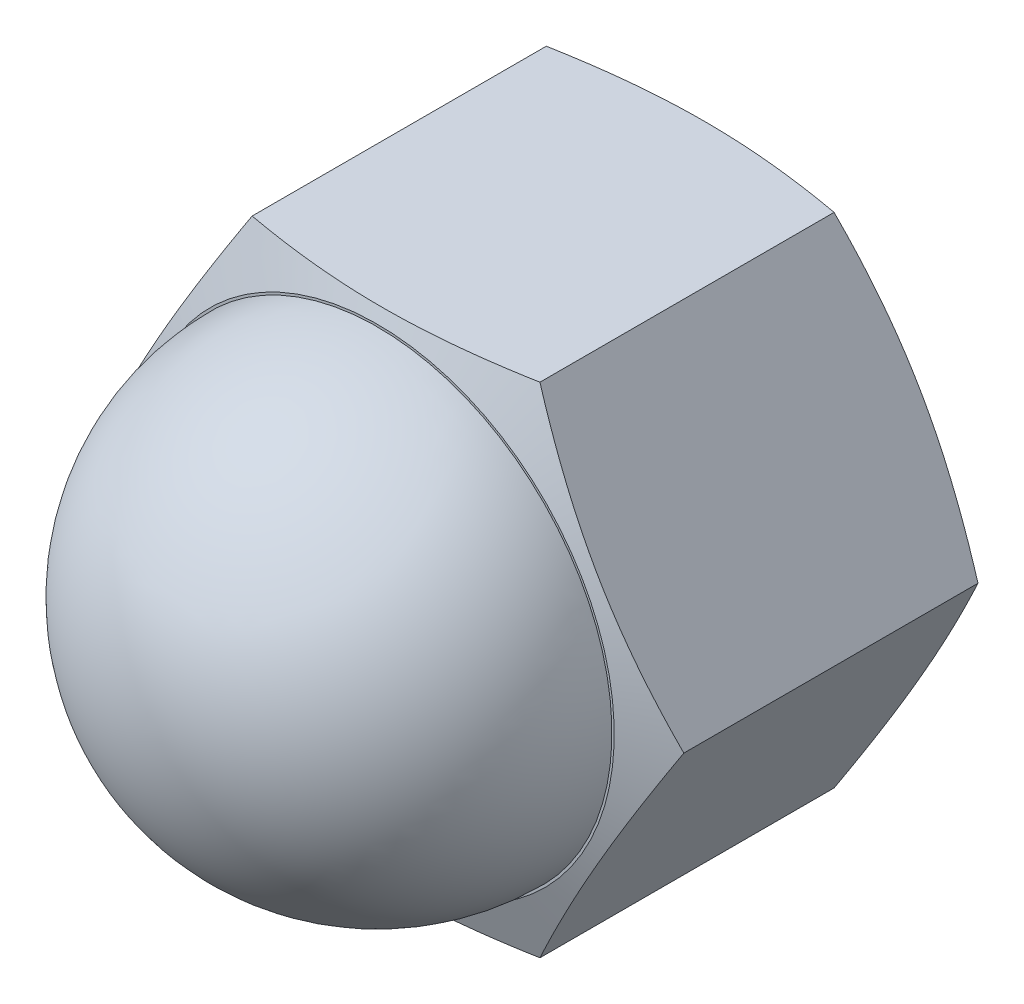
ISO-10303-21;
HEADER;
FILE_DESCRIPTION(('STEP AP214'),'2;1');
FILE_NAME('part.step','',(''),(''),'','','');
FILE_SCHEMA(('AUTOMOTIVE_DESIGN { 1 0 10303 214 1 1 1 1 }'));
ENDSEC;
DATA;
#1=APPLICATION_CONTEXT('core data for automotive mechanical design processes');
#2=APPLICATION_PROTOCOL_DEFINITION('international standard','automotive_design',2000,#1);
#3=PRODUCT_CONTEXT('',#1,'mechanical');
#4=PRODUCT('Part','Part','',(#3));
#5=PRODUCT_RELATED_PRODUCT_CATEGORY('part','',(#4));
#6=PRODUCT_DEFINITION_FORMATION('','',#4);
#7=PRODUCT_DEFINITION_CONTEXT('part definition',#1,'design');
#8=PRODUCT_DEFINITION('design','',#6,#7);
#9=PRODUCT_DEFINITION_SHAPE('','',#8);
#10=(LENGTH_UNIT() NAMED_UNIT(*) SI_UNIT(.MILLI.,.METRE.));
#11=(NAMED_UNIT(*) PLANE_ANGLE_UNIT() SI_UNIT($,.RADIAN.));
#12=(NAMED_UNIT(*) SI_UNIT($,.STERADIAN.) SOLID_ANGLE_UNIT());
#13=UNCERTAINTY_MEASURE_WITH_UNIT(LENGTH_MEASURE(1.E-05),#10,'distance_accuracy_value','');
#14=(GEOMETRIC_REPRESENTATION_CONTEXT(3) GLOBAL_UNCERTAINTY_ASSIGNED_CONTEXT((#13)) GLOBAL_UNIT_ASSIGNED_CONTEXT((#10,
#11,#12)) REPRESENTATION_CONTEXT('',''));
#15=CARTESIAN_POINT('',(0.,0.,0.));
#16=DIRECTION('',(0.,0.,1.));
#17=DIRECTION('',(1.,0.,0.));
#18=AXIS2_PLACEMENT_3D('',#15,#16,#17);
#19=CARTESIAN_POINT('',(0.,-9.77999999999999,0.));
#20=DIRECTION('',(0.,0.,-1.));
#21=DIRECTION('',(-1.,0.,0.));
#22=AXIS2_PLACEMENT_3D('',#19,#20,#21);
#23=PLANE('',#22);
#24=CARTESIAN_POINT('',(0.,0.,0.));
#25=DIRECTION('',(0.,0.,-1.));
#26=DIRECTION('',(-1.,0.,0.));
#27=AXIS2_PLACEMENT_3D('',#24,#25,#26);
#28=CIRCLE('',#27,4.6455);
#29=CARTESIAN_POINT('',(-4.6455,0.,0.));
#30=VERTEX_POINT('',#29);
#31=EDGE_CURVE('E362',#30,#30,#28,.T.);
#32=ORIENTED_EDGE('',*,*,#31,.F.);
#33=EDGE_LOOP('',(#32));
#34=FACE_BOUND('',#33,.T.);
#35=CARTESIAN_POINT('',(0.,0.,0.));
#36=DIRECTION('',(0.,0.,-1.));
#37=DIRECTION('',(-1.,0.,0.));
#38=AXIS2_PLACEMENT_3D('',#35,#36,#37);
#39=CIRCLE('',#38,4.6);
#40=CARTESIAN_POINT('',(-4.6,0.,0.));
#41=VERTEX_POINT('',#40);
#42=EDGE_CURVE('E129',#41,#41,#39,.F.);
#43=ORIENTED_EDGE('',*,*,#42,.F.);
#44=EDGE_LOOP('',(#43));
#45=FACE_BOUND('',#44,.T.);
#46=ADVANCED_FACE('F35',(#34,#45),#23,.F.);
#47=CARTESIAN_POINT('',(0.,0.,-6.5));
#48=DIRECTION('',(0.,0.,1.));
#49=DIRECTION('',(1.,0.,0.));
#50=AXIS2_PLACEMENT_3D('',#47,#48,#49);
#51=CYLINDRICAL_SURFACE('',#50,2.5);
#52=CARTESIAN_POINT('',(0.,0.,-5.85000000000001));
#53=DIRECTION('',(0.,0.,-1.));
#54=DIRECTION('',(-1.,0.,0.));
#55=AXIS2_PLACEMENT_3D('',#52,#53,#54);
#56=CIRCLE('',#55,2.5);
#57=CARTESIAN_POINT('',(2.5,0.,-5.85000000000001));
#58=VERTEX_POINT('',#57);
#59=EDGE_CURVE('E11',#58,#58,#56,.T.);
#60=CARTESIAN_POINT('',(0.,0.,-1.5));
#61=DIRECTION('',(0.,0.,1.));
#62=DIRECTION('',(1.,0.,0.));
#63=AXIS2_PLACEMENT_3D('',#60,#61,#62);
#64=CIRCLE('',#63,2.5);
#65=CARTESIAN_POINT('',(2.5,0.,-1.5));
#66=VERTEX_POINT('',#65);
#67=EDGE_CURVE('E126',#66,#66,#64,.F.);
#68=CARTESIAN_POINT('',(2.5,0.,-5.85000000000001));
#69=CARTESIAN_POINT('',(2.5,0.,-5.80468750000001));
#70=CARTESIAN_POINT('',(2.5,0.,-5.75937500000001));
#71=CARTESIAN_POINT('',(2.5,0.,-5.66875000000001));
#72=CARTESIAN_POINT('',(2.5,0.,-5.62343750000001));
#73=CARTESIAN_POINT('',(2.5,0.,-5.53281250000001));
#74=CARTESIAN_POINT('',(2.5,0.,-5.48750000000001));
#75=CARTESIAN_POINT('',(2.5,0.,-5.39687500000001));
#76=CARTESIAN_POINT('',(2.5,0.,-5.35156250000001));
#77=CARTESIAN_POINT('',(2.5,0.,-5.26093750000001));
#78=CARTESIAN_POINT('',(2.5,0.,-5.21562500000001));
#79=CARTESIAN_POINT('',(2.5,0.,-5.12500000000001));
#80=CARTESIAN_POINT('',(2.5,0.,-5.07968750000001));
#81=CARTESIAN_POINT('',(2.5,0.,-4.98906250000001));
#82=CARTESIAN_POINT('',(2.5,0.,-4.94375000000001));
#83=CARTESIAN_POINT('',(2.5,0.,-4.85312500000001));
#84=CARTESIAN_POINT('',(2.5,0.,-4.80781250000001));
#85=CARTESIAN_POINT('',(2.5,0.,-4.71718750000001));
#86=CARTESIAN_POINT('',(2.5,0.,-4.67187500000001));
#87=CARTESIAN_POINT('',(2.5,0.,-4.58125000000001));
#88=CARTESIAN_POINT('',(2.5,0.,-4.53593750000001));
#89=CARTESIAN_POINT('',(2.5,0.,-4.44531250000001));
#90=CARTESIAN_POINT('',(2.5,0.,-4.40000000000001));
#91=CARTESIAN_POINT('',(2.5,0.,-4.30937500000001));
#92=CARTESIAN_POINT('',(2.5,0.,-4.26406250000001));
#93=CARTESIAN_POINT('',(2.5,0.,-4.17343750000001));
#94=CARTESIAN_POINT('',(2.5,0.,-4.12812500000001));
#95=CARTESIAN_POINT('',(2.5,0.,-4.03750000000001));
#96=CARTESIAN_POINT('',(2.5,0.,-3.99218750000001));
#97=CARTESIAN_POINT('',(2.5,0.,-3.90156250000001));
#98=CARTESIAN_POINT('',(2.5,0.,-3.85625000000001));
#99=CARTESIAN_POINT('',(2.5,0.,-3.76562500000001));
#100=CARTESIAN_POINT('',(2.5,0.,-3.72031250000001));
#101=CARTESIAN_POINT('',(2.5,0.,-3.62968750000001));
#102=CARTESIAN_POINT('',(2.5,0.,-3.584375));
#103=CARTESIAN_POINT('',(2.5,0.,-3.49375000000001));
#104=CARTESIAN_POINT('',(2.5,0.,-3.4484375));
#105=CARTESIAN_POINT('',(2.5,0.,-3.3578125));
#106=CARTESIAN_POINT('',(2.5,0.,-3.3125));
#107=CARTESIAN_POINT('',(2.5,0.,-3.221875));
#108=CARTESIAN_POINT('',(2.5,0.,-3.1765625));
#109=CARTESIAN_POINT('',(2.5,0.,-3.0859375));
#110=CARTESIAN_POINT('',(2.5,0.,-3.040625));
#111=CARTESIAN_POINT('',(2.5,0.,-2.95));
#112=CARTESIAN_POINT('',(2.5,0.,-2.9046875));
#113=CARTESIAN_POINT('',(2.5,0.,-2.8140625));
#114=CARTESIAN_POINT('',(2.5,0.,-2.76875));
#115=CARTESIAN_POINT('',(2.5,0.,-2.678125));
#116=CARTESIAN_POINT('',(2.5,0.,-2.6328125));
#117=CARTESIAN_POINT('',(2.5,0.,-2.5421875));
#118=CARTESIAN_POINT('',(2.5,0.,-2.496875));
#119=CARTESIAN_POINT('',(2.5,0.,-2.40625));
#120=CARTESIAN_POINT('',(2.5,0.,-2.3609375));
#121=CARTESIAN_POINT('',(2.5,0.,-2.2703125));
#122=CARTESIAN_POINT('',(2.5,0.,-2.225));
#123=CARTESIAN_POINT('',(2.5,0.,-2.134375));
#124=CARTESIAN_POINT('',(2.5,0.,-2.0890625));
#125=CARTESIAN_POINT('',(2.5,0.,-1.9984375));
#126=CARTESIAN_POINT('',(2.5,0.,-1.953125));
#127=CARTESIAN_POINT('',(2.5,0.,-1.8625));
#128=CARTESIAN_POINT('',(2.5,0.,-1.8171875));
#129=CARTESIAN_POINT('',(2.5,0.,-1.7265625));
#130=CARTESIAN_POINT('',(2.5,0.,-1.68125));
#131=CARTESIAN_POINT('',(2.5,0.,-1.590625));
#132=CARTESIAN_POINT('',(2.5,0.,-1.5453125));
#133=CARTESIAN_POINT('',(2.5,0.,-1.5));
#134=B_SPLINE_CURVE_WITH_KNOTS('',3,(#68,#69,#70,#71,#72,#73,#74,#75,#76,#77,#78,#79,#80,#81,
#82,#83,#84,#85,#86,#87,#88,#89,#90,#91,#92,#93,#94,#95,#96,#97,#98,#99,#100,#101,#102,#103,
#104,#105,#106,#107,#108,#109,#110,#111,#112,#113,#114,#115,#116,#117,#118,#119,#120,#121,#122,
#123,#124,#125,#126,#127,#128,#129,#130,#131,#132,#133),.UNSPECIFIED.,.F.,.F.,(4,2,2,2,2,2,2,2,
2,2,2,2,2,2,2,2,2,2,2,2,2,2,2,2,2,2,2,2,2,2,2,2,4),(0.,0.1359375,0.271875,0.407812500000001,
0.543750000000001,0.679687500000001,0.815625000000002,0.951562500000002,1.0875,1.2234375,
1.359375,1.4953125,1.63125,1.7671875,1.903125,2.0390625,2.17500000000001,2.31093750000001,
2.44687500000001,2.58281250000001,2.71875000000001,2.85468750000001,2.99062500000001,
3.12656250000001,3.26250000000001,3.39843750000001,3.53437500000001,3.67031250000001,
3.80625000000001,3.94218750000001,4.07812500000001,4.21406250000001,4.35000000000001),.UNSPECIFIED.);
#135=EDGE_CURVE('BSEAM148',#58,#66,#134,.T.);
#136=ORIENTED_EDGE('',*,*,#59,.T.);
#137=ORIENTED_EDGE('',*,*,#67,.F.);
#138=ORIENTED_EDGE('',*,*,#135,.T.);
#139=ORIENTED_EDGE('',*,*,#135,.F.);
#140=EDGE_LOOP('',(#136,#138,#137,#139));
#141=FACE_BOUND('',#140,.T.);
#142=ADVANCED_FACE('F148',(#141),#51,.F.);
#143=CARTESIAN_POINT('',(2.82324281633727,-4.89,-6.5));
#144=DIRECTION('',(0.866025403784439,-0.5,0.));
#145=DIRECTION('',(0.5,0.866025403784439,0.));
#146=AXIS2_PLACEMENT_3D('',#143,#144,#145);
#147=PLANE('',#146);
#148=CARTESIAN_POINT('',(2.82312734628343,-4.8902,-0.364371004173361));
#149=CARTESIAN_POINT('',(2.94005354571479,-4.68767788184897,-0.321796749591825));
#150=CARTESIAN_POINT('',(3.05736532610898,-4.48448791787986,-0.28306804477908));
#151=CARTESIAN_POINT('',(3.29275168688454,-4.07678678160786,-0.214930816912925));
#152=CARTESIAN_POINT('',(3.4108267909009,-3.87227470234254,-0.18552958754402));
#153=CARTESIAN_POINT('',(3.64642938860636,-3.46419903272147,-0.137973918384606));
#154=CARTESIAN_POINT('',(3.76395150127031,-3.26064476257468,-0.119715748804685));
#155=CARTESIAN_POINT('',(3.9992705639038,-2.85306019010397,-0.0952264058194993));
#156=CARTESIAN_POINT('',(4.11706739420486,-2.64903009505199,-0.0889907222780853));
#157=CARTESIAN_POINT('',(4.35266105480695,-2.24096990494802,-0.0889907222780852));
#158=CARTESIAN_POINT('',(4.470457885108,-2.03693980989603,-0.0952264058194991));
#159=CARTESIAN_POINT('',(4.7057769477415,-1.62935523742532,-0.119715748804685));
#160=CARTESIAN_POINT('',(4.82329906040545,-1.42580096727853,-0.137973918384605));
#161=CARTESIAN_POINT('',(5.05890165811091,-1.01772529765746,-0.185529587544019));
#162=CARTESIAN_POINT('',(5.17697676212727,-0.813213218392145,-0.214930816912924));
#163=CARTESIAN_POINT('',(5.41236312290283,-0.405512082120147,-0.283068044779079));
#164=CARTESIAN_POINT('',(5.52967490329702,-0.202322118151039,-0.321796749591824));
#165=CARTESIAN_POINT('',(5.64660110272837,0.000199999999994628,-0.36437100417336));
#166=B_SPLINE_CURVE_WITH_KNOTS('',3,(#148,#149,#150,#151,#152,#153,#154,#155,#156,#157,#158,
#159,#160,#161,#162,#163,#164,#165),.UNSPECIFIED.,.F.,.F.,(4,2,2,2,2,2,2,2,4),(0.,
0.713162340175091,1.42688097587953,2.13385008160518,2.84055392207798,3.54725776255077,
4.25422686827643,4.96794550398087,5.68110784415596),.UNSPECIFIED.);
#167=CARTESIAN_POINT('',(2.82324281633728,-4.89,-0.364328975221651));
#168=VERTEX_POINT('',#167);
#169=CARTESIAN_POINT('',(5.64648563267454,0.,-0.364328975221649));
#170=VERTEX_POINT('',#169);
#171=EDGE_CURVE('E50',#168,#170,#166,.T.);
#172=ORIENTED_EDGE('',*,*,#171,.F.);
#173=DIRECTION('',(0.,0.,1.));
#174=VECTOR('',#173,1.);
#175=CARTESIAN_POINT('',(2.82324281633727,-4.89,-6.5));
#176=LINE('',#175,#174);
#177=CARTESIAN_POINT('',(2.82324281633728,-4.89,-6.13567102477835));
#178=VERTEX_POINT('',#177);
#179=EDGE_CURVE('E114',#178,#168,#176,.T.);
#180=ORIENTED_EDGE('',*,*,#179,.F.);
#181=CARTESIAN_POINT('',(5.64660110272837,0.000199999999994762,-6.13562899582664));
#182=CARTESIAN_POINT('',(5.52967490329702,-0.202322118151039,-6.17820325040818));
#183=CARTESIAN_POINT('',(5.41236312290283,-0.405512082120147,-6.21693195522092));
#184=CARTESIAN_POINT('',(5.17697676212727,-0.813213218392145,-6.28506918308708));
#185=CARTESIAN_POINT('',(5.05890165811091,-1.01772529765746,-6.31447041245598));
#186=CARTESIAN_POINT('',(4.82329906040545,-1.42580096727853,-6.36202608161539));
#187=CARTESIAN_POINT('',(4.7057769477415,-1.62935523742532,-6.38028425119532));
#188=CARTESIAN_POINT('',(4.470457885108,-2.03693980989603,-6.4047735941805));
#189=CARTESIAN_POINT('',(4.35266105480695,-2.24096990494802,-6.41100927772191));
#190=CARTESIAN_POINT('',(4.11706739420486,-2.64903009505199,-6.41100927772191));
#191=CARTESIAN_POINT('',(3.99927056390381,-2.85306019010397,-6.4047735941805));
#192=CARTESIAN_POINT('',(3.76395150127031,-3.26064476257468,-6.38028425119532));
#193=CARTESIAN_POINT('',(3.64642938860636,-3.46419903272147,-6.36202608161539));
#194=CARTESIAN_POINT('',(3.4108267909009,-3.87227470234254,-6.31447041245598));
#195=CARTESIAN_POINT('',(3.29275168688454,-4.07678678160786,-6.28506918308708));
#196=CARTESIAN_POINT('',(3.05736532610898,-4.48448791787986,-6.21693195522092));
#197=CARTESIAN_POINT('',(2.94005354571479,-4.68767788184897,-6.17820325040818));
#198=CARTESIAN_POINT('',(2.82312734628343,-4.8902,-6.13562899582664));
#199=B_SPLINE_CURVE_WITH_KNOTS('',3,(#181,#182,#183,#184,#185,#186,#187,#188,#189,#190,#191,
#192,#193,#194,#195,#196,#197,#198),.UNSPECIFIED.,.F.,.F.,(4,2,2,2,2,2,2,2,4),(0.,
0.71316234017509,1.42688097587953,2.13385008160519,2.84055392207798,3.54725776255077,
4.25422686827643,4.96794550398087,5.68110784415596),.UNSPECIFIED.);
#200=CARTESIAN_POINT('',(5.64648563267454,0.,-6.13567102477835));
#201=VERTEX_POINT('',#200);
#202=EDGE_CURVE('E125',#201,#178,#199,.T.);
#203=ORIENTED_EDGE('',*,*,#202,.F.);
#204=DIRECTION('',(0.,0.,1.));
#205=VECTOR('',#204,1.);
#206=CARTESIAN_POINT('',(5.64648563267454,0.,-6.5));
#207=LINE('',#206,#205);
#208=EDGE_CURVE('E122',#201,#170,#207,.T.);
#209=ORIENTED_EDGE('',*,*,#208,.T.);
#210=EDGE_LOOP('',(#172,#180,#203,#209));
#211=FACE_BOUND('',#210,.T.);
#212=ADVANCED_FACE('F154',(#211),#147,.T.);
#213=CARTESIAN_POINT('',(-2.82324281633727,-4.89,-6.5));
#214=DIRECTION('',(0.,-1.,0.));
#215=DIRECTION('',(1.,0.,0.));
#216=AXIS2_PLACEMENT_3D('',#213,#214,#215);
#217=PLANE('',#216);
#218=CARTESIAN_POINT('',(-7.46648006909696,-4.89,-1.55770848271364));
#219=CARTESIAN_POINT('',(-7.24532550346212,-4.89,-1.49038994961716));
#220=CARTESIAN_POINT('',(-7.02392678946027,-4.89,-1.42385881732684));
#221=CARTESIAN_POINT('',(-6.58051678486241,-4.89,-1.29280697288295));
#222=CARTESIAN_POINT('',(-6.35850544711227,-4.89,-1.22828642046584));
#223=CARTESIAN_POINT('',(-5.91336404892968,-4.89,-1.10158350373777));
#224=CARTESIAN_POINT('',(-5.69023267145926,-4.89,-1.03940574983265));
#225=CARTESIAN_POINT('',(-5.24313869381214,-4.89,-0.91811857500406));
#226=CARTESIAN_POINT('',(-5.01917610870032,-4.89,-0.859009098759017));
#227=CARTESIAN_POINT('',(-4.57304751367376,-4.89,-0.745325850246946));
#228=CARTESIAN_POINT('',(-4.35089355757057,-4.89,-0.690705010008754));
#229=CARTESIAN_POINT('',(-3.90549201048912,-4.89,-0.586129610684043));
#230=CARTESIAN_POINT('',(-3.68224446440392,-4.89,-0.536174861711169));
#231=CARTESIAN_POINT('',(-3.23458821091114,-4.89,-0.442094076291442));
#232=CARTESIAN_POINT('',(-3.01017989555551,-4.89,-0.397966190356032));
#233=CARTESIAN_POINT('',(-2.56006087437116,-4.89,-0.316886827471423));
#234=CARTESIAN_POINT('',(-2.33435021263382,-4.89,-0.279935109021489));
#235=CARTESIAN_POINT('',(-1.90705783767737,-4.89,-0.218370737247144));
#236=CARTESIAN_POINT('',(-1.70560980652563,-4.89,-0.192838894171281));
#237=CARTESIAN_POINT('',(-1.301864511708,-4.89,-0.14964780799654));
#238=CARTESIAN_POINT('',(-1.09956727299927,-4.89,-0.131988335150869));
#239=CARTESIAN_POINT('',(-0.694534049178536,-4.89,-0.105392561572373));
#240=CARTESIAN_POINT('',(-0.491798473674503,-4.89,-0.0964501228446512));
#241=CARTESIAN_POINT('',(-0.0861282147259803,-4.89,-0.0877409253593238));
#242=CARTESIAN_POINT('',(0.116806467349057,-4.89,-0.0879741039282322));
#243=CARTESIAN_POINT('',(0.523489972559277,-4.89,-0.0976280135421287));
#244=CARTESIAN_POINT('',(0.727237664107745,-4.89,-0.107095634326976));
#245=CARTESIAN_POINT('',(1.13413234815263,-4.89,-0.134783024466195));
#246=CARTESIAN_POINT('',(1.33727932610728,-4.89,-0.153003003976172));
#247=CARTESIAN_POINT('',(1.74287320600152,-4.89,-0.197344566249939));
#248=CARTESIAN_POINT('',(1.94531935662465,-4.89,-0.223472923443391));
#249=CARTESIAN_POINT('',(2.34919879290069,-4.89,-0.282573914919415));
#250=CARTESIAN_POINT('',(2.55063207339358,-4.89,-0.315546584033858));
#251=CARTESIAN_POINT('',(2.96373484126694,-4.89,-0.389278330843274));
#252=CARTESIAN_POINT('',(3.17534434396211,-4.89,-0.430370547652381));
#253=CARTESIAN_POINT('',(3.59747447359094,-4.89,-0.517843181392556));
#254=CARTESIAN_POINT('',(3.80799501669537,-4.89,-0.564223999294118));
#255=CARTESIAN_POINT('',(4.2280989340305,-4.89,-0.66129601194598));
#256=CARTESIAN_POINT('',(4.43768201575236,-4.89,-0.711988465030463));
#257=CARTESIAN_POINT('',(4.85596286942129,-4.89,-0.81686395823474));
#258=CARTESIAN_POINT('',(5.06466066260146,-4.89,-0.871046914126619));
#259=CARTESIAN_POINT('',(5.69015659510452,-4.89,-1.03795915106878));
#260=CARTESIAN_POINT('',(6.1058225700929,-4.89,-1.15492449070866));
#261=CARTESIAN_POINT('',(6.93487258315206,-4.89,-1.39634529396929));
#262=CARTESIAN_POINT('',(7.34825697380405,-4.89,-1.52079956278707));
#263=CARTESIAN_POINT('',(8.16879776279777,-4.89,-1.7734793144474));
#264=CARTESIAN_POINT('',(8.57597204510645,-4.89,-1.90164691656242));
#265=CARTESIAN_POINT('',(9.38917810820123,-4.89,-2.16160997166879));
#266=CARTESIAN_POINT('',(9.79520983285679,-4.89,-2.29340559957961));
#267=CARTESIAN_POINT('',(10.6048627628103,-4.89,-2.55913592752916));
#268=CARTESIAN_POINT('',(11.0084872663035,-4.89,-2.69306060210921));
#269=CARTESIAN_POINT('',(11.815030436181,-4.89,-2.96291077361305));
#270=CARTESIAN_POINT('',(12.2179491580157,-4.89,-3.09883610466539));
#271=CARTESIAN_POINT('',(12.6206270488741,-4.89,-3.23546098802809));
#272=B_SPLINE_CURVE_WITH_KNOTS('',3,(#218,#219,#220,#221,#222,#223,#224,#225,#226,#227,#228,
#229,#230,#231,#232,#233,#234,#235,#236,#237,#238,#239,#240,#241,#242,#243,#244,#245,#246,#247,
#248,#249,#250,#251,#252,#253,#254,#255,#256,#257,#258,#259,#260,#261,#262,#263,#264,#265,#266,
#267,#268,#269,#270,#271),.UNSPECIFIED.,.F.,.F.,(4,2,2,2,2,2,2,2,2,2,2,2,2,2,2,2,2,2,2,2,2,2,2,
2,2,2,4),(0.,0.693525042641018,1.38710504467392,2.08198536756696,2.77685315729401,
3.46312406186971,4.14936702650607,4.83539164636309,5.52139317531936,6.13043788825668,
6.73946482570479,7.34806261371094,7.95665624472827,8.56835630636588,9.18007105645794,
9.79231130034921,10.404554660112,11.0511588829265,11.6978121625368,12.3446548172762,
12.9914818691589,14.2867843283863,15.5818806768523,16.862465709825,18.1431125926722,
19.4188955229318,20.6945732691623),.UNSPECIFIED.);
#273=CARTESIAN_POINT('',(-2.82324281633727,-4.89000000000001,-0.364328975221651));
#274=VERTEX_POINT('',#273);
#275=EDGE_CURVE('E107',#274,#168,#272,.T.);
#276=ORIENTED_EDGE('',*,*,#275,.F.);
#277=DIRECTION('',(0.,0.,1.));
#278=VECTOR('',#277,1.);
#279=CARTESIAN_POINT('',(-2.82324281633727,-4.89,-6.5));
#280=LINE('',#279,#278);
#281=CARTESIAN_POINT('',(-2.82324281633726,-4.89000000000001,-6.13567102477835));
#282=VERTEX_POINT('',#281);
#283=EDGE_CURVE('E106',#282,#274,#280,.T.);
#284=ORIENTED_EDGE('',*,*,#283,.F.);
#285=CARTESIAN_POINT('',(-7.46648006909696,-4.89,-4.94229151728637));
#286=CARTESIAN_POINT('',(-7.24532550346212,-4.89,-5.00961005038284));
#287=CARTESIAN_POINT('',(-7.02392678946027,-4.89,-5.07614118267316));
#288=CARTESIAN_POINT('',(-6.58051678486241,-4.89,-5.20719302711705));
#289=CARTESIAN_POINT('',(-6.35850544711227,-4.89,-5.27171357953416));
#290=CARTESIAN_POINT('',(-5.91336404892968,-4.89,-5.39841649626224));
#291=CARTESIAN_POINT('',(-5.69023267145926,-4.89,-5.46059425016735));
#292=CARTESIAN_POINT('',(-5.24313869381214,-4.89,-5.58188142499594));
#293=CARTESIAN_POINT('',(-5.01917610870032,-4.89,-5.64099090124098));
#294=CARTESIAN_POINT('',(-4.57304751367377,-4.89,-5.75467414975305));
#295=CARTESIAN_POINT('',(-4.35089355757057,-4.89,-5.80929498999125));
#296=CARTESIAN_POINT('',(-3.90549201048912,-4.89,-5.91387038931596));
#297=CARTESIAN_POINT('',(-3.68224446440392,-4.89,-5.96382513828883));
#298=CARTESIAN_POINT('',(-3.23458821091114,-4.89,-6.05790592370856));
#299=CARTESIAN_POINT('',(-3.01017989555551,-4.89,-6.10203380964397));
#300=CARTESIAN_POINT('',(-2.56006087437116,-4.89,-6.18311317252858));
#301=CARTESIAN_POINT('',(-2.33435021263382,-4.89,-6.22006489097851));
#302=CARTESIAN_POINT('',(-1.90705783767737,-4.89,-6.28162926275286));
#303=CARTESIAN_POINT('',(-1.70560980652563,-4.89,-6.30716110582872));
#304=CARTESIAN_POINT('',(-1.301864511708,-4.89,-6.35035219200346));
#305=CARTESIAN_POINT('',(-1.09956727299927,-4.89,-6.36801166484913));
#306=CARTESIAN_POINT('',(-0.694534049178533,-4.89,-6.39460743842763));
#307=CARTESIAN_POINT('',(-0.4917984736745,-4.89,-6.40354987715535));
#308=CARTESIAN_POINT('',(-0.0861282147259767,-4.89,-6.41225907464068));
#309=CARTESIAN_POINT('',(0.116806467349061,-4.89,-6.41202589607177));
#310=CARTESIAN_POINT('',(0.523489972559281,-4.89,-6.40237198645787));
#311=CARTESIAN_POINT('',(0.727237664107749,-4.89,-6.39290436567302));
#312=CARTESIAN_POINT('',(1.13413234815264,-4.89,-6.36521697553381));
#313=CARTESIAN_POINT('',(1.33727932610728,-4.89,-6.34699699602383));
#314=CARTESIAN_POINT('',(1.74287320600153,-4.89,-6.30265543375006));
#315=CARTESIAN_POINT('',(1.94531935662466,-4.89,-6.27652707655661));
#316=CARTESIAN_POINT('',(2.3491987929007,-4.89,-6.21742608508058));
#317=CARTESIAN_POINT('',(2.55063207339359,-4.89,-6.18445341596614));
#318=CARTESIAN_POINT('',(2.96373484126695,-4.89,-6.11072166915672));
#319=CARTESIAN_POINT('',(3.17534434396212,-4.89,-6.06962945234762));
#320=CARTESIAN_POINT('',(3.59747447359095,-4.89,-5.98215681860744));
#321=CARTESIAN_POINT('',(3.80799501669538,-4.89,-5.93577600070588));
#322=CARTESIAN_POINT('',(4.22809893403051,-4.89,-5.83870398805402));
#323=CARTESIAN_POINT('',(4.43768201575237,-4.89,-5.78801153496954));
#324=CARTESIAN_POINT('',(4.85596286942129,-4.89,-5.68313604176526));
#325=CARTESIAN_POINT('',(5.06466066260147,-4.89,-5.62895308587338));
#326=CARTESIAN_POINT('',(5.69015659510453,-4.89,-5.46204084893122));
#327=CARTESIAN_POINT('',(6.10582257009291,-4.89,-5.34507550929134));
#328=CARTESIAN_POINT('',(6.93487258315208,-4.89,-5.10365470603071));
#329=CARTESIAN_POINT('',(7.34825697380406,-4.89,-4.97920043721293));
#330=CARTESIAN_POINT('',(8.16879776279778,-4.89,-4.7265206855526));
#331=CARTESIAN_POINT('',(8.57597204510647,-4.89,-4.59835308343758));
#332=CARTESIAN_POINT('',(9.38917810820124,-4.89,-4.33839002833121));
#333=CARTESIAN_POINT('',(9.79520983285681,-4.89,-4.20659440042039));
#334=CARTESIAN_POINT('',(10.6048627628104,-4.89,-3.94086407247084));
#335=CARTESIAN_POINT('',(11.0084872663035,-4.89,-3.80693939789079));
#336=CARTESIAN_POINT('',(11.8150304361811,-4.89,-3.53708922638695));
#337=CARTESIAN_POINT('',(12.2179491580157,-4.89,-3.40116389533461));
#338=CARTESIAN_POINT('',(12.6206270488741,-4.89,-3.26453901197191));
#339=B_SPLINE_CURVE_WITH_KNOTS('',3,(#285,#286,#287,#288,#289,#290,#291,#292,#293,#294,#295,
#296,#297,#298,#299,#300,#301,#302,#303,#304,#305,#306,#307,#308,#309,#310,#311,#312,#313,#314,
#315,#316,#317,#318,#319,#320,#321,#322,#323,#324,#325,#326,#327,#328,#329,#330,#331,#332,#333,
#334,#335,#336,#337,#338),.UNSPECIFIED.,.F.,.F.,(4,2,2,2,2,2,2,2,2,2,2,2,2,2,2,2,2,2,2,2,2,2,2,
2,2,2,4),(0.,0.693525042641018,1.38710504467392,2.08198536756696,2.77685315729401,
3.46312406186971,4.14936702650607,4.83539164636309,5.52139317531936,6.13043788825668,
6.7394648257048,7.34806261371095,7.95665624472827,8.56835630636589,9.18007105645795,
9.79231130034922,10.404554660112,11.0511588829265,11.6978121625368,12.3446548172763,
12.991481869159,14.2867843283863,15.5818806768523,16.862465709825,18.1431125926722,
19.4188955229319,20.6945732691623),.UNSPECIFIED.);
#340=EDGE_CURVE('E170',#178,#282,#339,.F.);
#341=ORIENTED_EDGE('',*,*,#340,.F.);
#342=ORIENTED_EDGE('',*,*,#179,.T.);
#343=EDGE_LOOP('',(#276,#284,#341,#342));
#344=FACE_BOUND('',#343,.T.);
#345=ADVANCED_FACE('F161',(#344),#217,.T.);
#346=CARTESIAN_POINT('',(-5.64648563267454,0.,-6.5));
#347=DIRECTION('',(-0.866025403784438,-0.5,0.));
#348=DIRECTION('',(0.5,-0.866025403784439,0.));
#349=AXIS2_PLACEMENT_3D('',#346,#347,#348);
#350=PLANE('',#349);
#351=CARTESIAN_POINT('',(-5.64660110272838,0.000200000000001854,-0.364371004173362));
#352=CARTESIAN_POINT('',(-5.52967490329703,-0.202322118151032,-0.321796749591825));
#353=CARTESIAN_POINT('',(-5.41236312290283,-0.40551208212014,-0.283068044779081));
#354=CARTESIAN_POINT('',(-5.17697676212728,-0.813213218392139,-0.214930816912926));
#355=CARTESIAN_POINT('',(-5.05890165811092,-1.01772529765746,-0.18552958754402));
#356=CARTESIAN_POINT('',(-4.82329906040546,-1.42580096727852,-0.137973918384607));
#357=CARTESIAN_POINT('',(-4.70577694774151,-1.62935523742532,-0.119715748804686));
#358=CARTESIAN_POINT('',(-4.47045788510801,-2.03693980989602,-0.0952264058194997));
#359=CARTESIAN_POINT('',(-4.35266105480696,-2.24096990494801,-0.0889907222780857));
#360=CARTESIAN_POINT('',(-4.11706739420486,-2.64903009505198,-0.0889907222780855));
#361=CARTESIAN_POINT('',(-3.99927056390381,-2.85306019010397,-0.0952264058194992));
#362=CARTESIAN_POINT('',(-3.76395150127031,-3.26064476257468,-0.119715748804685));
#363=CARTESIAN_POINT('',(-3.64642938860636,-3.46419903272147,-0.137973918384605));
#364=CARTESIAN_POINT('',(-3.4108267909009,-3.87227470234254,-0.185529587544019));
#365=CARTESIAN_POINT('',(-3.29275168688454,-4.07678678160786,-0.214930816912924));
#366=CARTESIAN_POINT('',(-3.05736532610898,-4.48448791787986,-0.28306804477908));
#367=CARTESIAN_POINT('',(-2.94005354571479,-4.68767788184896,-0.321796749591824));
#368=CARTESIAN_POINT('',(-2.82312734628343,-4.8902,-0.364371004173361));
#369=B_SPLINE_CURVE_WITH_KNOTS('',3,(#351,#352,#353,#354,#355,#356,#357,#358,#359,#360,#361,
#362,#363,#364,#365,#366,#367,#368),.UNSPECIFIED.,.F.,.F.,(4,2,2,2,2,2,2,2,4),(0.,
0.713162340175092,1.42688097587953,2.13385008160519,2.84055392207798,3.54725776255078,
4.25422686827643,4.96794550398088,5.68110784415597),.UNSPECIFIED.);
#370=CARTESIAN_POINT('',(-5.64648563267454,0.,-0.364328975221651));
#371=VERTEX_POINT('',#370);
#372=EDGE_CURVE('E90',#371,#274,#369,.T.);
#373=ORIENTED_EDGE('',*,*,#372,.F.);
#374=DIRECTION('',(0.,0.,1.));
#375=VECTOR('',#374,1.);
#376=CARTESIAN_POINT('',(-5.64648563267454,0.,-6.5));
#377=LINE('',#376,#375);
#378=CARTESIAN_POINT('',(-5.64648563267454,0.,-6.13567102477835));
#379=VERTEX_POINT('',#378);
#380=EDGE_CURVE('E104',#379,#371,#377,.T.);
#381=ORIENTED_EDGE('',*,*,#380,.F.);
#382=CARTESIAN_POINT('',(-2.82312734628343,-4.8902,-6.13562899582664));
#383=CARTESIAN_POINT('',(-2.94005354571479,-4.68767788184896,-6.17820325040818));
#384=CARTESIAN_POINT('',(-3.05736532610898,-4.48448791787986,-6.21693195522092));
#385=CARTESIAN_POINT('',(-3.29275168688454,-4.07678678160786,-6.28506918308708));
#386=CARTESIAN_POINT('',(-3.4108267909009,-3.87227470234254,-6.31447041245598));
#387=CARTESIAN_POINT('',(-3.64642938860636,-3.46419903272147,-6.36202608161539));
#388=CARTESIAN_POINT('',(-3.76395150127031,-3.26064476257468,-6.38028425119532));
#389=CARTESIAN_POINT('',(-3.99927056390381,-2.85306019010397,-6.4047735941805));
#390=CARTESIAN_POINT('',(-4.11706739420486,-2.64903009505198,-6.41100927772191));
#391=CARTESIAN_POINT('',(-4.35266105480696,-2.24096990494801,-6.41100927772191));
#392=CARTESIAN_POINT('',(-4.47045788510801,-2.03693980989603,-6.4047735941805));
#393=CARTESIAN_POINT('',(-4.70577694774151,-1.62935523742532,-6.38028425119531));
#394=CARTESIAN_POINT('',(-4.82329906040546,-1.42580096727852,-6.36202608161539));
#395=CARTESIAN_POINT('',(-5.05890165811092,-1.01772529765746,-6.31447041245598));
#396=CARTESIAN_POINT('',(-5.17697676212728,-0.813213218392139,-6.28506918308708));
#397=CARTESIAN_POINT('',(-5.41236312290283,-0.40551208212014,-6.21693195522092));
#398=CARTESIAN_POINT('',(-5.52967490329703,-0.202322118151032,-6.17820325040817));
#399=CARTESIAN_POINT('',(-5.64660110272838,0.000200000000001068,-6.13562899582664));
#400=B_SPLINE_CURVE_WITH_KNOTS('',3,(#382,#383,#384,#385,#386,#387,#388,#389,#390,#391,#392,
#393,#394,#395,#396,#397,#398,#399),.UNSPECIFIED.,.F.,.F.,(4,2,2,2,2,2,2,2,4),(0.,
0.713162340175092,1.42688097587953,2.13385008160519,2.84055392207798,3.54725776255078,
4.25422686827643,4.96794550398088,5.68110784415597),.UNSPECIFIED.);
#401=EDGE_CURVE('E233',#282,#379,#400,.T.);
#402=ORIENTED_EDGE('',*,*,#401,.F.);
#403=ORIENTED_EDGE('',*,*,#283,.T.);
#404=EDGE_LOOP('',(#373,#381,#402,#403));
#405=FACE_BOUND('',#404,.T.);
#406=ADVANCED_FACE('F102',(#405),#350,.T.);
#407=CARTESIAN_POINT('',(-2.82324281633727,4.89,-6.5));
#408=DIRECTION('',(-0.866025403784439,0.5,0.));
#409=DIRECTION('',(-0.5,-0.866025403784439,0.));
#410=AXIS2_PLACEMENT_3D('',#407,#408,#409);
#411=PLANE('',#410);
#412=CARTESIAN_POINT('',(-2.82312734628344,4.8902,-0.364371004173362));
#413=CARTESIAN_POINT('',(-2.94005354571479,4.68767788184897,-0.321796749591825));
#414=CARTESIAN_POINT('',(-3.05736532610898,4.48448791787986,-0.283068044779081));
#415=CARTESIAN_POINT('',(-3.29275168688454,4.07678678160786,-0.214930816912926));
#416=CARTESIAN_POINT('',(-3.4108267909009,3.87227470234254,-0.185529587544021));
#417=CARTESIAN_POINT('',(-3.64642938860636,3.46419903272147,-0.137973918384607));
#418=CARTESIAN_POINT('',(-3.76395150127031,3.26064476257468,-0.119715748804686));
#419=CARTESIAN_POINT('',(-3.99927056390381,2.85306019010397,-0.0952264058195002));
#420=CARTESIAN_POINT('',(-4.11706739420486,2.64903009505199,-0.0889907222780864));
#421=CARTESIAN_POINT('',(-4.35266105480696,2.24096990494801,-0.0889907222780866));
#422=CARTESIAN_POINT('',(-4.47045788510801,2.03693980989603,-0.0952264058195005));
#423=CARTESIAN_POINT('',(-4.70577694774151,1.62935523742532,-0.119715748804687));
#424=CARTESIAN_POINT('',(-4.82329906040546,1.42580096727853,-0.137973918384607));
#425=CARTESIAN_POINT('',(-5.05890165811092,1.01772529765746,-0.185529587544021));
#426=CARTESIAN_POINT('',(-5.17697676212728,0.813213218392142,-0.214930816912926));
#427=CARTESIAN_POINT('',(-5.41236312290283,0.405512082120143,-0.283068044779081));
#428=CARTESIAN_POINT('',(-5.52967490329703,0.202322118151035,-0.321796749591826));
#429=CARTESIAN_POINT('',(-5.64660110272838,-0.000199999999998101,-0.364371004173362));
#430=B_SPLINE_CURVE_WITH_KNOTS('',3,(#412,#413,#414,#415,#416,#417,#418,#419,#420,#421,#422,
#423,#424,#425,#426,#427,#428,#429),.UNSPECIFIED.,.F.,.F.,(4,2,2,2,2,2,2,2,4),(0.,
0.713162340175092,1.42688097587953,2.13385008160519,2.84055392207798,3.54725776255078,
4.25422686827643,4.96794550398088,5.68110784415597),.UNSPECIFIED.);
#431=CARTESIAN_POINT('',(-2.82324281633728,4.89,-0.364328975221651));
#432=VERTEX_POINT('',#431);
#433=EDGE_CURVE('E86',#432,#371,#430,.T.);
#434=ORIENTED_EDGE('',*,*,#433,.F.);
#435=DIRECTION('',(0.,0.,1.));
#436=VECTOR('',#435,1.);
#437=CARTESIAN_POINT('',(-2.82324281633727,4.89,-6.5));
#438=LINE('',#437,#436);
#439=CARTESIAN_POINT('',(-2.82324281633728,4.89,-6.13567102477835));
#440=VERTEX_POINT('',#439);
#441=EDGE_CURVE('E112',#440,#432,#438,.T.);
#442=ORIENTED_EDGE('',*,*,#441,.F.);
#443=CARTESIAN_POINT('',(-5.64660110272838,-0.000199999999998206,-6.13562899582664));
#444=CARTESIAN_POINT('',(-5.52967490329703,0.202322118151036,-6.17820325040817));
#445=CARTESIAN_POINT('',(-5.41236312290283,0.405512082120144,-6.21693195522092));
#446=CARTESIAN_POINT('',(-5.17697676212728,0.813213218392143,-6.28506918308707));
#447=CARTESIAN_POINT('',(-5.05890165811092,1.01772529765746,-6.31447041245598));
#448=CARTESIAN_POINT('',(-4.82329906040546,1.42580096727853,-6.36202608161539));
#449=CARTESIAN_POINT('',(-4.70577694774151,1.62935523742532,-6.38028425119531));
#450=CARTESIAN_POINT('',(-4.47045788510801,2.03693980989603,-6.4047735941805));
#451=CARTESIAN_POINT('',(-4.35266105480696,2.24096990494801,-6.41100927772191));
#452=CARTESIAN_POINT('',(-4.11706739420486,2.64903009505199,-6.41100927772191));
#453=CARTESIAN_POINT('',(-3.99927056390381,2.85306019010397,-6.4047735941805));
#454=CARTESIAN_POINT('',(-3.76395150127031,3.26064476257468,-6.38028425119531));
#455=CARTESIAN_POINT('',(-3.64642938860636,3.46419903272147,-6.36202608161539));
#456=CARTESIAN_POINT('',(-3.4108267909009,3.87227470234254,-6.31447041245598));
#457=CARTESIAN_POINT('',(-3.29275168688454,4.07678678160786,-6.28506918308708));
#458=CARTESIAN_POINT('',(-3.05736532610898,4.48448791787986,-6.21693195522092));
#459=CARTESIAN_POINT('',(-2.94005354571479,4.68767788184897,-6.17820325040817));
#460=CARTESIAN_POINT('',(-2.82312734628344,4.8902,-6.13562899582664));
#461=B_SPLINE_CURVE_WITH_KNOTS('',3,(#443,#444,#445,#446,#447,#448,#449,#450,#451,#452,#453,
#454,#455,#456,#457,#458,#459,#460),.UNSPECIFIED.,.F.,.F.,(4,2,2,2,2,2,2,2,4),(0.,
0.713162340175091,1.42688097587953,2.13385008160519,2.84055392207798,3.54725776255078,
4.25422686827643,4.96794550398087,5.68110784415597),.UNSPECIFIED.);
#462=EDGE_CURVE('E111',#379,#440,#461,.T.);
#463=ORIENTED_EDGE('',*,*,#462,.F.);
#464=ORIENTED_EDGE('',*,*,#380,.T.);
#465=EDGE_LOOP('',(#434,#442,#463,#464));
#466=FACE_BOUND('',#465,.T.);
#467=ADVANCED_FACE('F110',(#466),#411,.T.);
#468=CARTESIAN_POINT('',(2.82324281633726,4.89,-6.5));
#469=DIRECTION('',(0.,1.,0.));
#470=DIRECTION('',(0.,0.,1.));
#471=AXIS2_PLACEMENT_3D('',#468,#469,#470);
#472=PLANE('',#471);
#473=CARTESIAN_POINT('',(-7.46648006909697,4.89,-1.55770848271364));
#474=CARTESIAN_POINT('',(-7.24532550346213,4.89,-1.49038994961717));
#475=CARTESIAN_POINT('',(-7.02392678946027,4.89,-1.42385881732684));
#476=CARTESIAN_POINT('',(-6.58051678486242,4.89,-1.29280697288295));
#477=CARTESIAN_POINT('',(-6.35850544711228,4.89,-1.22828642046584));
#478=CARTESIAN_POINT('',(-5.91336404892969,4.89,-1.10158350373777));
#479=CARTESIAN_POINT('',(-5.69023267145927,4.89,-1.03940574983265));
#480=CARTESIAN_POINT('',(-5.24313869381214,4.89,-0.918118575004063));
#481=CARTESIAN_POINT('',(-5.01917610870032,4.89,-0.859009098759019));
#482=CARTESIAN_POINT('',(-4.57304751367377,4.89,-0.745325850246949));
#483=CARTESIAN_POINT('',(-4.35089355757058,4.89,-0.690705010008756));
#484=CARTESIAN_POINT('',(-3.90549201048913,4.89,-0.586129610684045));
#485=CARTESIAN_POINT('',(-3.68224446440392,4.89,-0.536174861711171));
#486=CARTESIAN_POINT('',(-3.23458821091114,4.89,-0.442094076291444));
#487=CARTESIAN_POINT('',(-3.01017989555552,4.89,-0.397966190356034));
#488=CARTESIAN_POINT('',(-2.56006087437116,4.89,-0.316886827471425));
#489=CARTESIAN_POINT('',(-2.33435021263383,4.89,-0.279935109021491));
#490=CARTESIAN_POINT('',(-1.90705783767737,4.89,-0.218370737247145));
#491=CARTESIAN_POINT('',(-1.70560980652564,4.89,-0.192838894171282));
#492=CARTESIAN_POINT('',(-1.301864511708,4.89,-0.149647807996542));
#493=CARTESIAN_POINT('',(-1.09956727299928,4.89,-0.13198833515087));
#494=CARTESIAN_POINT('',(-0.69453404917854,4.89,-0.105392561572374));
#495=CARTESIAN_POINT('',(-0.491798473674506,4.89,-0.096450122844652));
#496=CARTESIAN_POINT('',(-0.0861282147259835,4.89,-0.0877409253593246));
#497=CARTESIAN_POINT('',(0.116806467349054,4.89,-0.0879741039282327));
#498=CARTESIAN_POINT('',(0.523489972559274,4.89,-0.0976280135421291));
#499=CARTESIAN_POINT('',(0.727237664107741,4.89,-0.107095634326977));
#500=CARTESIAN_POINT('',(1.13413234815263,4.89,-0.134783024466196));
#501=CARTESIAN_POINT('',(1.33727932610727,4.89,-0.153003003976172));
#502=CARTESIAN_POINT('',(1.74287320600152,4.89,-0.197344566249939));
#503=CARTESIAN_POINT('',(1.94531935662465,4.89,-0.223472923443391));
#504=CARTESIAN_POINT('',(2.34919879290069,4.89,-0.282573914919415));
#505=CARTESIAN_POINT('',(2.55063207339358,4.89,-0.315546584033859));
#506=CARTESIAN_POINT('',(2.96373484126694,4.89,-0.389278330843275));
#507=CARTESIAN_POINT('',(3.17534434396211,4.89,-0.430370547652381));
#508=CARTESIAN_POINT('',(3.59747447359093,4.89,-0.517843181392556));
#509=CARTESIAN_POINT('',(3.80799501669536,4.89,-0.564223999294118));
#510=CARTESIAN_POINT('',(4.22809893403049,4.89,-0.66129601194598));
#511=CARTESIAN_POINT('',(4.43768201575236,4.89,-0.711988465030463));
#512=CARTESIAN_POINT('',(4.85596286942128,4.89,-0.81686395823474));
#513=CARTESIAN_POINT('',(5.06466066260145,4.89,-0.871046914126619));
#514=CARTESIAN_POINT('',(5.69015659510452,4.89,-1.03795915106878));
#515=CARTESIAN_POINT('',(6.10582257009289,4.89,-1.15492449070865));
#516=CARTESIAN_POINT('',(6.93487258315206,4.89,-1.39634529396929));
#517=CARTESIAN_POINT('',(7.34825697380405,4.89,-1.52079956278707));
#518=CARTESIAN_POINT('',(8.16879776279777,4.89,-1.7734793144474));
#519=CARTESIAN_POINT('',(8.57597204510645,4.89,-1.90164691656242));
#520=CARTESIAN_POINT('',(9.38917810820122,4.89,-2.16160997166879));
#521=CARTESIAN_POINT('',(9.79520983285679,4.89,-2.2934055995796));
#522=CARTESIAN_POINT('',(10.6048627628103,4.89,-2.55913592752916));
#523=CARTESIAN_POINT('',(11.0084872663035,4.89,-2.69306060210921));
#524=CARTESIAN_POINT('',(11.815030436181,4.89,-2.96291077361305));
#525=CARTESIAN_POINT('',(12.2179491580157,4.89,-3.09883610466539));
#526=CARTESIAN_POINT('',(12.6206270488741,4.89,-3.23546098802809));
#527=B_SPLINE_CURVE_WITH_KNOTS('',3,(#473,#474,#475,#476,#477,#478,#479,#480,#481,#482,#483,
#484,#485,#486,#487,#488,#489,#490,#491,#492,#493,#494,#495,#496,#497,#498,#499,#500,#501,#502,
#503,#504,#505,#506,#507,#508,#509,#510,#511,#512,#513,#514,#515,#516,#517,#518,#519,#520,#521,
#522,#523,#524,#525,#526),.UNSPECIFIED.,.F.,.F.,(4,2,2,2,2,2,2,2,2,2,2,2,2,2,2,2,2,2,2,2,2,2,2,
2,2,2,4),(0.,0.693525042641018,1.38710504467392,2.08198536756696,2.77685315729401,
3.46312406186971,4.14936702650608,4.83539164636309,5.52139317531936,6.13043788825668,
6.73946482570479,7.34806261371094,7.95665624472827,8.56835630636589,9.18007105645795,
9.79231130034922,10.404554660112,11.0511588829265,11.6978121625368,12.3446548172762,
12.9914818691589,14.2867843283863,15.5818806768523,16.862465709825,18.1431125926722,
19.4188955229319,20.6945732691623),.UNSPECIFIED.);
#528=CARTESIAN_POINT('',(2.82324281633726,4.89000000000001,-0.364328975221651));
#529=VERTEX_POINT('',#528);
#530=EDGE_CURVE('E93',#529,#432,#527,.F.);
#531=ORIENTED_EDGE('',*,*,#530,.F.);
#532=DIRECTION('',(0.,0.,1.));
#533=VECTOR('',#532,1.);
#534=CARTESIAN_POINT('',(2.82324281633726,4.89,-6.5));
#535=LINE('',#534,#533);
#536=CARTESIAN_POINT('',(2.82324281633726,4.89,-6.13567102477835));
#537=VERTEX_POINT('',#536);
#538=EDGE_CURVE('E116',#537,#529,#535,.T.);
#539=ORIENTED_EDGE('',*,*,#538,.F.);
#540=CARTESIAN_POINT('',(-7.46648006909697,4.89,-4.94229151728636));
#541=CARTESIAN_POINT('',(-7.24532550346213,4.89,-5.00961005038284));
#542=CARTESIAN_POINT('',(-7.02392678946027,4.89,-5.07614118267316));
#543=CARTESIAN_POINT('',(-6.58051678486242,4.89,-5.20719302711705));
#544=CARTESIAN_POINT('',(-6.35850544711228,4.89,-5.27171357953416));
#545=CARTESIAN_POINT('',(-5.91336404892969,4.89,-5.39841649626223));
#546=CARTESIAN_POINT('',(-5.69023267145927,4.89,-5.46059425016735));
#547=CARTESIAN_POINT('',(-5.24313869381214,4.89,-5.58188142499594));
#548=CARTESIAN_POINT('',(-5.01917610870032,4.89,-5.64099090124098));
#549=CARTESIAN_POINT('',(-4.57304751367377,4.89,-5.75467414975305));
#550=CARTESIAN_POINT('',(-4.35089355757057,4.89,-5.80929498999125));
#551=CARTESIAN_POINT('',(-3.90549201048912,4.89,-5.91387038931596));
#552=CARTESIAN_POINT('',(-3.68224446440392,4.89,-5.96382513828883));
#553=CARTESIAN_POINT('',(-3.23458821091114,4.89,-6.05790592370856));
#554=CARTESIAN_POINT('',(-3.01017989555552,4.89,-6.10203380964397));
#555=CARTESIAN_POINT('',(-2.56006087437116,4.89,-6.18311317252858));
#556=CARTESIAN_POINT('',(-2.33435021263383,4.89,-6.22006489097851));
#557=CARTESIAN_POINT('',(-1.90705783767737,4.89,-6.28162926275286));
#558=CARTESIAN_POINT('',(-1.70560980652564,4.89,-6.30716110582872));
#559=CARTESIAN_POINT('',(-1.301864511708,4.89,-6.35035219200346));
#560=CARTESIAN_POINT('',(-1.09956727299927,4.89,-6.36801166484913));
#561=CARTESIAN_POINT('',(-0.694534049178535,4.89,-6.39460743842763));
#562=CARTESIAN_POINT('',(-0.491798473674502,4.89,-6.40354987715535));
#563=CARTESIAN_POINT('',(-0.0861282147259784,4.89,-6.41225907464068));
#564=CARTESIAN_POINT('',(0.116806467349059,4.89,-6.41202589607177));
#565=CARTESIAN_POINT('',(0.52348997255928,4.89,-6.40237198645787));
#566=CARTESIAN_POINT('',(0.727237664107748,4.89,-6.39290436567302));
#567=CARTESIAN_POINT('',(1.13413234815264,4.89,-6.3652169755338));
#568=CARTESIAN_POINT('',(1.33727932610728,4.89,-6.34699699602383));
#569=CARTESIAN_POINT('',(1.74287320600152,4.89,-6.30265543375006));
#570=CARTESIAN_POINT('',(1.94531935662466,4.89,-6.27652707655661));
#571=CARTESIAN_POINT('',(2.3491987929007,4.89,-6.21742608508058));
#572=CARTESIAN_POINT('',(2.55063207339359,4.89,-6.18445341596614));
#573=CARTESIAN_POINT('',(2.96373484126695,4.89,-6.11072166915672));
#574=CARTESIAN_POINT('',(3.17534434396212,4.89,-6.06962945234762));
#575=CARTESIAN_POINT('',(3.59747447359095,4.89,-5.98215681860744));
#576=CARTESIAN_POINT('',(3.80799501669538,4.89,-5.93577600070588));
#577=CARTESIAN_POINT('',(4.2280989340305,4.89,-5.83870398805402));
#578=CARTESIAN_POINT('',(4.43768201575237,4.89,-5.78801153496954));
#579=CARTESIAN_POINT('',(4.85596286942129,4.89,-5.68313604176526));
#580=CARTESIAN_POINT('',(5.06466066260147,4.89,-5.62895308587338));
#581=CARTESIAN_POINT('',(5.69015659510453,4.89,-5.46204084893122));
#582=CARTESIAN_POINT('',(6.1058225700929,4.89,-5.34507550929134));
#583=CARTESIAN_POINT('',(6.93487258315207,4.89,-5.10365470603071));
#584=CARTESIAN_POINT('',(7.34825697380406,4.89,-4.97920043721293));
#585=CARTESIAN_POINT('',(8.16879776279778,4.89,-4.7265206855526));
#586=CARTESIAN_POINT('',(8.57597204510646,4.89,-4.59835308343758));
#587=CARTESIAN_POINT('',(9.38917810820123,4.89,-4.33839002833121));
#588=CARTESIAN_POINT('',(9.7952098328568,4.89,-4.2065944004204));
#589=CARTESIAN_POINT('',(10.6048627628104,4.89,-3.94086407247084));
#590=CARTESIAN_POINT('',(11.0084872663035,4.89,-3.80693939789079));
#591=CARTESIAN_POINT('',(11.815030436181,4.89,-3.53708922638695));
#592=CARTESIAN_POINT('',(12.2179491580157,4.89,-3.40116389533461));
#593=CARTESIAN_POINT('',(12.6206270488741,4.89,-3.26453901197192));
#594=B_SPLINE_CURVE_WITH_KNOTS('',3,(#540,#541,#542,#543,#544,#545,#546,#547,#548,#549,#550,
#551,#552,#553,#554,#555,#556,#557,#558,#559,#560,#561,#562,#563,#564,#565,#566,#567,#568,#569,
#570,#571,#572,#573,#574,#575,#576,#577,#578,#579,#580,#581,#582,#583,#584,#585,#586,#587,#588,
#589,#590,#591,#592,#593),.UNSPECIFIED.,.F.,.F.,(4,2,2,2,2,2,2,2,2,2,2,2,2,2,2,2,2,2,2,2,2,2,2,
2,2,2,4),(0.,0.693525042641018,1.38710504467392,2.08198536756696,2.77685315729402,
3.46312406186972,4.14936702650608,4.83539164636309,5.52139317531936,6.13043788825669,
6.7394648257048,7.34806261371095,7.95665624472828,8.56835630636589,9.18007105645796,
9.79231130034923,10.404554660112,11.0511588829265,11.6978121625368,12.3446548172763,
12.991481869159,14.2867843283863,15.5818806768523,16.862465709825,18.1431125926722,
19.4188955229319,20.6945732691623),.UNSPECIFIED.);
#595=EDGE_CURVE('E58',#440,#537,#594,.T.);
#596=ORIENTED_EDGE('',*,*,#595,.F.);
#597=ORIENTED_EDGE('',*,*,#441,.T.);
#598=EDGE_LOOP('',(#531,#539,#596,#597));
#599=FACE_BOUND('',#598,.T.);
#600=ADVANCED_FACE('F224',(#599),#472,.T.);
#601=CARTESIAN_POINT('',(5.64648563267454,0.,-6.5));
#602=DIRECTION('',(0.866025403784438,0.5,0.));
#603=DIRECTION('',(-0.5,0.866025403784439,0.));
#604=AXIS2_PLACEMENT_3D('',#601,#602,#603);
#605=PLANE('',#604);
#606=CARTESIAN_POINT('',(5.64660110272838,-0.000200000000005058,-0.36437100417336));
#607=CARTESIAN_POINT('',(5.52967490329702,0.202322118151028,-0.321796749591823));
#608=CARTESIAN_POINT('',(5.41236312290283,0.405512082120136,-0.283068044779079));
#609=CARTESIAN_POINT('',(5.17697676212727,0.813213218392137,-0.214930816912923));
#610=CARTESIAN_POINT('',(5.05890165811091,1.01772529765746,-0.185529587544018));
#611=CARTESIAN_POINT('',(4.82329906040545,1.42580096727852,-0.137973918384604));
#612=CARTESIAN_POINT('',(4.7057769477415,1.62935523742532,-0.119715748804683));
#613=CARTESIAN_POINT('',(4.470457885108,2.03693980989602,-0.0952264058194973));
#614=CARTESIAN_POINT('',(4.35266105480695,2.24096990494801,-0.0889907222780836));
#615=CARTESIAN_POINT('',(4.11706739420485,2.64903009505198,-0.0889907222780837));
#616=CARTESIAN_POINT('',(3.9992705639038,2.85306019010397,-0.0952264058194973));
#617=CARTESIAN_POINT('',(3.7639515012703,3.26064476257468,-0.119715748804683));
#618=CARTESIAN_POINT('',(3.64642938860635,3.46419903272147,-0.137973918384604));
#619=CARTESIAN_POINT('',(3.41082679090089,3.87227470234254,-0.185529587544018));
#620=CARTESIAN_POINT('',(3.29275168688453,4.07678678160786,-0.214930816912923));
#621=CARTESIAN_POINT('',(3.05736532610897,4.48448791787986,-0.283068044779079));
#622=CARTESIAN_POINT('',(2.94005354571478,4.68767788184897,-0.321796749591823));
#623=CARTESIAN_POINT('',(2.82312734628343,4.8902,-0.36437100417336));
#624=B_SPLINE_CURVE_WITH_KNOTS('',3,(#606,#607,#608,#609,#610,#611,#612,#613,#614,#615,#616,
#617,#618,#619,#620,#621,#622,#623),.UNSPECIFIED.,.F.,.F.,(4,2,2,2,2,2,2,2,4),(0.,
0.713162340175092,1.42688097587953,2.13385008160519,2.84055392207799,3.54725776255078,
4.25422686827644,4.96794550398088,5.68110784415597),.UNSPECIFIED.);
#625=EDGE_CURVE('E202',#170,#529,#624,.T.);
#626=ORIENTED_EDGE('',*,*,#625,.F.);
#627=ORIENTED_EDGE('',*,*,#208,.F.);
#628=CARTESIAN_POINT('',(2.82312734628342,4.8902,-6.13562899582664));
#629=CARTESIAN_POINT('',(2.94005354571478,4.68767788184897,-6.17820325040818));
#630=CARTESIAN_POINT('',(3.05736532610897,4.48448791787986,-6.21693195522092));
#631=CARTESIAN_POINT('',(3.29275168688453,4.07678678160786,-6.28506918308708));
#632=CARTESIAN_POINT('',(3.41082679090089,3.87227470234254,-6.31447041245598));
#633=CARTESIAN_POINT('',(3.64642938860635,3.46419903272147,-6.3620260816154));
#634=CARTESIAN_POINT('',(3.7639515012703,3.26064476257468,-6.38028425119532));
#635=CARTESIAN_POINT('',(3.9992705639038,2.85306019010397,-6.4047735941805));
#636=CARTESIAN_POINT('',(4.11706739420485,2.64903009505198,-6.41100927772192));
#637=CARTESIAN_POINT('',(4.35266105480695,2.24096990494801,-6.41100927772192));
#638=CARTESIAN_POINT('',(4.470457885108,2.03693980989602,-6.4047735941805));
#639=CARTESIAN_POINT('',(4.7057769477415,1.62935523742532,-6.38028425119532));
#640=CARTESIAN_POINT('',(4.82329906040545,1.42580096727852,-6.3620260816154));
#641=CARTESIAN_POINT('',(5.05890165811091,1.01772529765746,-6.31447041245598));
#642=CARTESIAN_POINT('',(5.17697676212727,0.813213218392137,-6.28506918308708));
#643=CARTESIAN_POINT('',(5.41236312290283,0.405512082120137,-6.21693195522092));
#644=CARTESIAN_POINT('',(5.52967490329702,0.202322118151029,-6.17820325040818));
#645=CARTESIAN_POINT('',(5.64660110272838,-0.000200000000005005,-6.13562899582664));
#646=B_SPLINE_CURVE_WITH_KNOTS('',3,(#628,#629,#630,#631,#632,#633,#634,#635,#636,#637,#638,
#639,#640,#641,#642,#643,#644,#645),.UNSPECIFIED.,.F.,.F.,(4,2,2,2,2,2,2,2,4),(0.,
0.713162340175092,1.42688097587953,2.13385008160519,2.84055392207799,3.54725776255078,
4.25422686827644,4.96794550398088,5.68110784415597),.UNSPECIFIED.);
#647=EDGE_CURVE('E258',#537,#201,#646,.T.);
#648=ORIENTED_EDGE('',*,*,#647,.F.);
#649=ORIENTED_EDGE('',*,*,#538,.T.);
#650=EDGE_LOOP('',(#626,#627,#648,#649));
#651=FACE_BOUND('',#650,.T.);
#652=ADVANCED_FACE('F252',(#651),#605,.T.);
#653=CARTESIAN_POINT('',(0.,-9.77999999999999,-6.5));
#654=DIRECTION('',(0.,0.,-1.));
#655=DIRECTION('',(-1.,0.,0.));
#656=AXIS2_PLACEMENT_3D('',#653,#654,#655);
#657=PLANE('',#656);
#658=CARTESIAN_POINT('',(0.,0.,-6.5));
#659=DIRECTION('',(0.,0.,-1.));
#660=DIRECTION('',(-1.,0.,0.));
#661=AXIS2_PLACEMENT_3D('',#658,#659,#660);
#662=CIRCLE('',#661,2.87527767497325);
#663=CARTESIAN_POINT('',(-2.87527767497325,0.,-6.5));
#664=VERTEX_POINT('',#663);
#665=EDGE_CURVE('E43',#664,#664,#662,.F.);
#666=ORIENTED_EDGE('',*,*,#665,.T.);
#667=EDGE_LOOP('',(#666));
#668=FACE_BOUND('',#667,.T.);
#669=CARTESIAN_POINT('',(0.,0.,-6.5));
#670=DIRECTION('',(0.,0.,-1.));
#671=DIRECTION('',(-1.,0.,0.));
#672=AXIS2_PLACEMENT_3D('',#669,#670,#671);
#673=CIRCLE('',#672,4.6455);
#674=CARTESIAN_POINT('',(-4.6455,0.,-6.5));
#675=VERTEX_POINT('',#674);
#676=EDGE_CURVE('E263',#675,#675,#673,.T.);
#677=ORIENTED_EDGE('',*,*,#676,.T.);
#678=EDGE_LOOP('',(#677));
#679=FACE_BOUND('',#678,.T.);
#680=ADVANCED_FACE('F134',(#668,#679),#657,.T.);
#681=CARTESIAN_POINT('',(0.,0.,-6.13567102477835));
#682=DIRECTION('',(0.,0.,1.));
#683=DIRECTION('',(1.,0.,0.));
#684=AXIS2_PLACEMENT_3D('',#681,#682,#683);
#685=CONICAL_SURFACE('',#684,5.64648563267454,1.22173047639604);
#686=ORIENTED_EDGE('',*,*,#202,.T.);
#687=ORIENTED_EDGE('',*,*,#340,.T.);
#688=ORIENTED_EDGE('',*,*,#401,.T.);
#689=ORIENTED_EDGE('',*,*,#462,.T.);
#690=ORIENTED_EDGE('',*,*,#595,.T.);
#691=ORIENTED_EDGE('',*,*,#647,.T.);
#692=EDGE_LOOP('',(#686,#687,#688,#689,#690,#691));
#693=FACE_BOUND('',#692,.T.);
#694=ORIENTED_EDGE('',*,*,#676,.F.);
#695=EDGE_LOOP('',(#694));
#696=FACE_BOUND('',#695,.T.);
#697=ADVANCED_FACE('F196',(#693,#696),#685,.T.);
#698=CARTESIAN_POINT('',(0.,0.,0.));
#699=DIRECTION('',(0.,0.,-1.));
#700=DIRECTION('',(-1.,0.,0.));
#701=AXIS2_PLACEMENT_3D('',#698,#699,#700);
#702=CONICAL_SURFACE('',#701,4.6455,1.22173047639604);
#703=ORIENTED_EDGE('',*,*,#171,.T.);
#704=ORIENTED_EDGE('',*,*,#625,.T.);
#705=ORIENTED_EDGE('',*,*,#530,.T.);
#706=ORIENTED_EDGE('',*,*,#433,.T.);
#707=ORIENTED_EDGE('',*,*,#372,.T.);
#708=ORIENTED_EDGE('',*,*,#275,.T.);
#709=EDGE_LOOP('',(#703,#704,#705,#706,#707,#708));
#710=FACE_BOUND('',#709,.T.);
#711=ORIENTED_EDGE('',*,*,#31,.T.);
#712=EDGE_LOOP('',(#711));
#713=FACE_BOUND('',#712,.T.);
#714=ADVANCED_FACE('F88',(#710,#713),#702,.T.);
#715=CARTESIAN_POINT('',(0.,0.,-1.5));
#716=DIRECTION('',(0.,0.,1.));
#717=DIRECTION('',(1.,0.,0.));
#718=AXIS2_PLACEMENT_3D('',#715,#716,#717);
#719=PLANE('',#718);
#720=ORIENTED_EDGE('',*,*,#67,.T.);
#721=EDGE_LOOP('',(#720));
#722=FACE_BOUND('',#721,.T.);
#723=ADVANCED_FACE('F143',(#722),#719,.F.);
#724=CARTESIAN_POINT('',(0.,0.,0.));
#725=DIRECTION('',(0.,0.,-1.));
#726=DIRECTION('',(-1.,0.,0.));
#727=AXIS2_PLACEMENT_3D('',#724,#725,#726);
#728=SPHERICAL_SURFACE('',#727,4.6);
#729=ORIENTED_EDGE('',*,*,#42,.T.);
#730=EDGE_LOOP('',(#729));
#731=FACE_BOUND('',#730,.T.);
#732=ADVANCED_FACE('F138',(#731),#728,.T.);
#733=CARTESIAN_POINT('',(0.,0.,-6.5));
#734=DIRECTION('',(0.,0.,-1.));
#735=DIRECTION('',(-1.,0.,0.));
#736=AXIS2_PLACEMENT_3D('',#733,#734,#735);
#737=CONICAL_SURFACE('',#736,2.87527767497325,0.523598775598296);
#738=ORIENTED_EDGE('',*,*,#59,.F.);
#739=EDGE_LOOP('',(#738));
#740=FACE_BOUND('',#739,.T.);
#741=ORIENTED_EDGE('',*,*,#665,.F.);
#742=EDGE_LOOP('',(#741));
#743=FACE_BOUND('',#742,.T.);
#744=ADVANCED_FACE('F37',(#740,#743),#737,.F.);
#745=CLOSED_SHELL('',(#46,#142,#212,#345,#406,#467,#600,#652,#680,#697,#714,#723,#732,#744));
#746=MANIFOLD_SOLID_BREP('B2',#745);
#747=ADVANCED_BREP_SHAPE_REPRESENTATION('',(#18,#746),#14);
#748=SHAPE_DEFINITION_REPRESENTATION(#9,#747);
ENDSEC;
END-ISO-10303-21;
